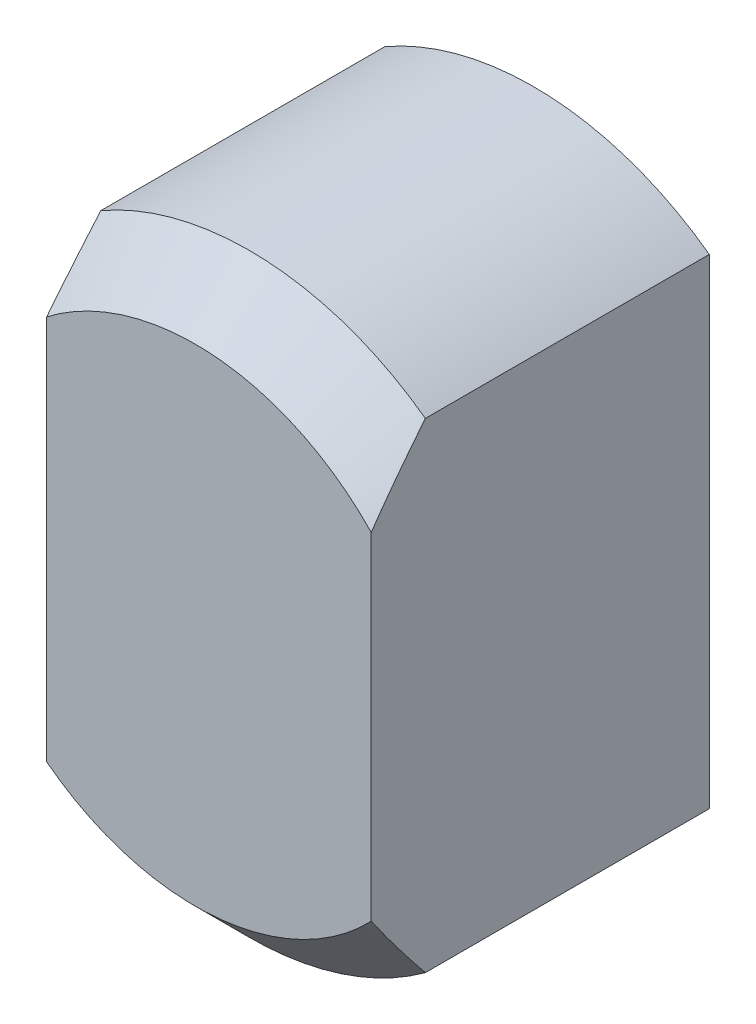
ISO-10303-21;
HEADER;
FILE_DESCRIPTION(('STEP AP214'),'2;1');
FILE_NAME('part.step','',(''),(''),'','','');
FILE_SCHEMA(('AUTOMOTIVE_DESIGN { 1 0 10303 214 1 1 1 1 }'));
ENDSEC;
DATA;
#1=APPLICATION_CONTEXT('core data for automotive mechanical design processes');
#2=APPLICATION_PROTOCOL_DEFINITION('international standard','automotive_design',2000,#1);
#3=PRODUCT_CONTEXT('',#1,'mechanical');
#4=PRODUCT('Part','Part','',(#3));
#5=PRODUCT_RELATED_PRODUCT_CATEGORY('part','',(#4));
#6=PRODUCT_DEFINITION_FORMATION('','',#4);
#7=PRODUCT_DEFINITION_CONTEXT('part definition',#1,'design');
#8=PRODUCT_DEFINITION('design','',#6,#7);
#9=PRODUCT_DEFINITION_SHAPE('','',#8);
#10=(LENGTH_UNIT() NAMED_UNIT(*) SI_UNIT(.MILLI.,.METRE.));
#11=(NAMED_UNIT(*) PLANE_ANGLE_UNIT() SI_UNIT($,.RADIAN.));
#12=(NAMED_UNIT(*) SI_UNIT($,.STERADIAN.) SOLID_ANGLE_UNIT());
#13=UNCERTAINTY_MEASURE_WITH_UNIT(LENGTH_MEASURE(1.E-05),#10,'distance_accuracy_value','');
#14=(GEOMETRIC_REPRESENTATION_CONTEXT(3) GLOBAL_UNCERTAINTY_ASSIGNED_CONTEXT((#13)) GLOBAL_UNIT_ASSIGNED_CONTEXT((#10,
#11,#12)) REPRESENTATION_CONTEXT('',''));
#15=CARTESIAN_POINT('',(0.,0.,0.));
#16=DIRECTION('',(0.,0.,1.));
#17=DIRECTION('',(1.,0.,0.));
#18=AXIS2_PLACEMENT_3D('',#15,#16,#17);
#19=CARTESIAN_POINT('',(0.,0.,158.75));
#20=DIRECTION('',(0.,0.,-1.));
#21=DIRECTION('',(-1.,0.,0.));
#22=AXIS2_PLACEMENT_3D('',#19,#20,#21);
#23=CYLINDRICAL_SURFACE('',#22,139.7);
#24=DIRECTION('',(0.,0.,-1.));
#25=VECTOR('',#24,1.);
#26=CARTESIAN_POINT('',(82.55,-112.701319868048,158.75));
#27=LINE('',#26,#25);
#28=CARTESIAN_POINT('',(82.55,-112.701319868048,133.35));
#29=VERTEX_POINT('',#28);
#30=CARTESIAN_POINT('',(82.55,-112.701319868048,0.));
#31=VERTEX_POINT('',#30);
#32=EDGE_CURVE('E86',#29,#31,#27,.T.);
#33=ORIENTED_EDGE('',*,*,#32,.F.);
#34=CARTESIAN_POINT('',(0.,0.,133.35));
#35=DIRECTION('',(0.,0.,-1.));
#36=DIRECTION('',(-1.,0.,0.));
#37=AXIS2_PLACEMENT_3D('',#34,#35,#36);
#38=CIRCLE('',#37,139.7);
#39=CARTESIAN_POINT('',(-69.85,-120.983748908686,133.35));
#40=VERTEX_POINT('',#39);
#41=EDGE_CURVE('E57',#29,#40,#38,.T.);
#42=ORIENTED_EDGE('',*,*,#41,.T.);
#43=DIRECTION('',(0.,0.,-1.));
#44=VECTOR('',#43,1.);
#45=CARTESIAN_POINT('',(-69.85,-120.983748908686,158.75));
#46=LINE('',#45,#44);
#47=CARTESIAN_POINT('',(-69.85,-120.983748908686,0.));
#48=VERTEX_POINT('',#47);
#49=EDGE_CURVE('E106',#40,#48,#46,.T.);
#50=ORIENTED_EDGE('',*,*,#49,.T.);
#51=CARTESIAN_POINT('',(0.,0.,0.));
#52=DIRECTION('',(0.,0.,1.));
#53=DIRECTION('',(-1.,0.,0.));
#54=AXIS2_PLACEMENT_3D('',#51,#52,#53);
#55=CIRCLE('',#54,139.7);
#56=EDGE_CURVE('E102',#48,#31,#55,.T.);
#57=ORIENTED_EDGE('',*,*,#56,.T.);
#58=EDGE_LOOP('',(#33,#42,#50,#57));
#59=FACE_BOUND('',#58,.T.);
#60=ADVANCED_FACE('F33',(#59),#23,.T.);
#61=CARTESIAN_POINT('',(82.55,-112.701319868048,158.75));
#62=DIRECTION('',(-1.,0.,0.));
#63=DIRECTION('',(0.,0.,1.));
#64=AXIS2_PLACEMENT_3D('',#61,#62,#63);
#65=PLANE('',#64);
#66=DIRECTION('',(0.,1.,0.));
#67=VECTOR('',#66,1.);
#68=CARTESIAN_POINT('',(82.55,-112.701319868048,158.75));
#69=LINE('',#68,#67);
#70=CARTESIAN_POINT('',(82.55,-79.0568624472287,158.75));
#71=VERTEX_POINT('',#70);
#72=CARTESIAN_POINT('',(82.55,79.0568624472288,158.75));
#73=VERTEX_POINT('',#72);
#74=EDGE_CURVE('E116',#71,#73,#69,.T.);
#75=ORIENTED_EDGE('',*,*,#74,.F.);
#76=CARTESIAN_POINT('',(82.55,-79.0568624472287,158.75));
#77=CARTESIAN_POINT('',(82.55,-80.502125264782,157.75030576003));
#78=CARTESIAN_POINT('',(82.55,-81.9407325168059,156.741040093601));
#79=CARTESIAN_POINT('',(82.55,-84.8056291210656,154.705259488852));
#80=CARTESIAN_POINT('',(82.55,-86.2319188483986,153.67874507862));
#81=CARTESIAN_POINT('',(82.55,-89.0727979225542,151.610636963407));
#82=CARTESIAN_POINT('',(82.55,-90.4873909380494,150.569048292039));
#83=CARTESIAN_POINT('',(82.55,-93.3062755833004,148.472007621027));
#84=CARTESIAN_POINT('',(82.55,-94.7105671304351,147.416555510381));
#85=CARTESIAN_POINT('',(82.55,-97.509527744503,145.293281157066));
#86=CARTESIAN_POINT('',(82.55,-98.904197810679,144.225460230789));
#87=CARTESIAN_POINT('',(82.55,-101.684821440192,142.078533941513));
#88=CARTESIAN_POINT('',(82.55,-103.070775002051,140.9994285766));
#89=CARTESIAN_POINT('',(82.55,-105.835115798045,138.83063092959));
#90=CARTESIAN_POINT('',(82.55,-107.213500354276,137.740935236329));
#91=CARTESIAN_POINT('',(82.55,-109.962831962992,135.552229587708));
#92=CARTESIAN_POINT('',(82.55,-111.333779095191,134.453219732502));
#93=CARTESIAN_POINT('',(82.55,-112.701319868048,133.35));
#94=B_SPLINE_CURVE_WITH_KNOTS('',3,(#76,#77,#78,#79,#80,#81,#82,#83,#84,#85,#86,#87,#88,#89,#90,
#91,#92,#93),.UNSPECIFIED.,.F.,.F.,(4,2,2,2,2,2,2,2,4),(0.,5.27187913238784,10.5435971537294,
15.8135936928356,21.0836324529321,26.3531153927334,31.6225992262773,36.8938406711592,
42.1650255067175),.UNSPECIFIED.);
#95=EDGE_CURVE('E93',#71,#29,#94,.T.);
#96=ORIENTED_EDGE('',*,*,#95,.T.);
#97=ORIENTED_EDGE('',*,*,#32,.T.);
#98=DIRECTION('',(0.,1.,0.));
#99=VECTOR('',#98,1.);
#100=CARTESIAN_POINT('',(82.55,-112.701319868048,0.));
#101=LINE('',#100,#99);
#102=CARTESIAN_POINT('',(82.55,112.701319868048,0.));
#103=VERTEX_POINT('',#102);
#104=EDGE_CURVE('E91',#31,#103,#101,.T.);
#105=ORIENTED_EDGE('',*,*,#104,.T.);
#106=DIRECTION('',(0.,0.,-1.));
#107=VECTOR('',#106,1.);
#108=CARTESIAN_POINT('',(82.55,112.701319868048,158.75));
#109=LINE('',#108,#107);
#110=CARTESIAN_POINT('',(82.55,112.701319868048,133.35));
#111=VERTEX_POINT('',#110);
#112=EDGE_CURVE('E96',#111,#103,#109,.T.);
#113=ORIENTED_EDGE('',*,*,#112,.F.);
#114=CARTESIAN_POINT('',(82.55,112.701319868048,133.35));
#115=CARTESIAN_POINT('',(82.55,111.333779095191,134.453219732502));
#116=CARTESIAN_POINT('',(82.55,109.962831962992,135.552229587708));
#117=CARTESIAN_POINT('',(82.55,107.213500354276,137.740935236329));
#118=CARTESIAN_POINT('',(82.55,105.835115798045,138.83063092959));
#119=CARTESIAN_POINT('',(82.55,103.070775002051,140.9994285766));
#120=CARTESIAN_POINT('',(82.55,101.684821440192,142.078533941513));
#121=CARTESIAN_POINT('',(82.55,98.904197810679,144.225460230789));
#122=CARTESIAN_POINT('',(82.55,97.509527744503,145.293281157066));
#123=CARTESIAN_POINT('',(82.55,94.7105671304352,147.416555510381));
#124=CARTESIAN_POINT('',(82.55,93.3062755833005,148.472007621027));
#125=CARTESIAN_POINT('',(82.55,90.4873909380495,150.569048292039));
#126=CARTESIAN_POINT('',(82.55,89.0727979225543,151.610636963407));
#127=CARTESIAN_POINT('',(82.55,86.2319188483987,153.67874507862));
#128=CARTESIAN_POINT('',(82.55,84.8056291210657,154.705259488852));
#129=CARTESIAN_POINT('',(82.55,81.940732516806,156.741040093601));
#130=CARTESIAN_POINT('',(82.55,80.5021252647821,157.75030576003));
#131=CARTESIAN_POINT('',(82.55,79.0568624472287,158.75));
#132=B_SPLINE_CURVE_WITH_KNOTS('',3,(#114,#115,#116,#117,#118,#119,#120,#121,#122,#123,#124,
#125,#126,#127,#128,#129,#130,#131),.UNSPECIFIED.,.F.,.F.,(4,2,2,2,2,2,2,2,4),(0.,
5.27118483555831,10.5424262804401,15.811910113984,21.0813930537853,26.3514318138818,
31.6214283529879,36.8931463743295,42.1650255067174),.UNSPECIFIED.);
#133=EDGE_CURVE('E126',#111,#73,#132,.T.);
#134=ORIENTED_EDGE('',*,*,#133,.T.);
#135=EDGE_LOOP('',(#75,#96,#97,#105,#113,#134));
#136=FACE_BOUND('',#135,.T.);
#137=ADVANCED_FACE('F89',(#136),#65,.F.);
#138=CARTESIAN_POINT('',(0.,0.,158.75));
#139=DIRECTION('',(0.,0.,-1.));
#140=DIRECTION('',(-1.,0.,0.));
#141=AXIS2_PLACEMENT_3D('',#138,#139,#140);
#142=CYLINDRICAL_SURFACE('',#141,139.7);
#143=DIRECTION('',(0.,0.,-1.));
#144=VECTOR('',#143,1.);
#145=CARTESIAN_POINT('',(-69.85,120.983748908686,158.75));
#146=LINE('',#145,#144);
#147=CARTESIAN_POINT('',(-69.85,120.983748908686,133.35));
#148=VERTEX_POINT('',#147);
#149=CARTESIAN_POINT('',(-69.85,120.983748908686,0.));
#150=VERTEX_POINT('',#149);
#151=EDGE_CURVE('E118',#148,#150,#146,.T.);
#152=ORIENTED_EDGE('',*,*,#151,.F.);
#153=CARTESIAN_POINT('',(0.,0.,133.35));
#154=DIRECTION('',(0.,0.,-1.));
#155=DIRECTION('',(-1.,0.,0.));
#156=AXIS2_PLACEMENT_3D('',#153,#154,#155);
#157=CIRCLE('',#156,139.7);
#158=EDGE_CURVE('E11',#148,#111,#157,.T.);
#159=ORIENTED_EDGE('',*,*,#158,.T.);
#160=ORIENTED_EDGE('',*,*,#112,.T.);
#161=CARTESIAN_POINT('',(0.,0.,0.));
#162=DIRECTION('',(0.,0.,1.));
#163=DIRECTION('',(1.,0.,0.));
#164=AXIS2_PLACEMENT_3D('',#161,#162,#163);
#165=CIRCLE('',#164,139.7);
#166=EDGE_CURVE('E104',#103,#150,#165,.T.);
#167=ORIENTED_EDGE('',*,*,#166,.T.);
#168=EDGE_LOOP('',(#152,#159,#160,#167));
#169=FACE_BOUND('',#168,.T.);
#170=ADVANCED_FACE('F140',(#169),#142,.T.);
#171=CARTESIAN_POINT('',(-69.85,120.983748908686,158.75));
#172=DIRECTION('',(1.,0.,0.));
#173=DIRECTION('',(0.,0.,-1.));
#174=AXIS2_PLACEMENT_3D('',#171,#172,#173);
#175=PLANE('',#174);
#176=ORIENTED_EDGE('',*,*,#49,.F.);
#177=CARTESIAN_POINT('',(-69.85,-120.983748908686,133.35));
#178=CARTESIAN_POINT('',(-69.85,-119.733186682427,134.433010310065));
#179=CARTESIAN_POINT('',(-69.85,-118.480558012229,135.513631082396));
#180=CARTESIAN_POINT('',(-69.85,-115.97080932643,137.669653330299));
#181=CARTESIAN_POINT('',(-69.85,-114.713689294,138.745054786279));
#182=CARTESIAN_POINT('',(-69.85,-110.935378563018,141.962493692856));
#183=CARTESIAN_POINT('',(-69.85,-108.406929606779,144.096032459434));
#184=CARTESIAN_POINT('',(-69.85,-104.59718655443,147.275971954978));
#185=CARTESIAN_POINT('',(-69.85,-103.324401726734,148.33257786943));
#186=CARTESIAN_POINT('',(-69.85,-100.772650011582,150.438296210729));
#187=CARTESIAN_POINT('',(-69.85,-99.4936831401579,151.487408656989));
#188=CARTESIAN_POINT('',(-69.85,-96.9288738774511,153.577509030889));
#189=CARTESIAN_POINT('',(-69.85,-95.6430306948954,154.618495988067));
#190=CARTESIAN_POINT('',(-69.85,-93.0639792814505,156.69133042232));
#191=CARTESIAN_POINT('',(-69.85,-91.7707709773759,157.723177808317));
#192=CARTESIAN_POINT('',(-69.85,-90.4735734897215,158.75));
#193=B_SPLINE_CURVE_WITH_KNOTS('',3,(#177,#178,#179,#180,#181,#182,#183,#184,#185,#186,#187,
#188,#189,#190,#191,#192),.UNSPECIFIED.,.F.,.F.,(4,2,2,2,2,2,2,4),(0.,4.96298979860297,
9.92599821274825,19.8507935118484,24.8133890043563,29.7759716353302,34.7391381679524,
39.7023541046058),.UNSPECIFIED.);
#194=CARTESIAN_POINT('',(-69.85,-90.4735734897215,158.75));
#195=VERTEX_POINT('',#194);
#196=EDGE_CURVE('E42',#40,#195,#193,.T.);
#197=ORIENTED_EDGE('',*,*,#196,.T.);
#198=DIRECTION('',(0.,-1.,0.));
#199=VECTOR('',#198,1.);
#200=CARTESIAN_POINT('',(-69.85,120.983748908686,158.75));
#201=LINE('',#200,#199);
#202=CARTESIAN_POINT('',(-69.85,90.4735734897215,158.75));
#203=VERTEX_POINT('',#202);
#204=EDGE_CURVE('E110',#203,#195,#201,.T.);
#205=ORIENTED_EDGE('',*,*,#204,.F.);
#206=CARTESIAN_POINT('',(-69.85,90.4735734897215,158.75));
#207=CARTESIAN_POINT('',(-69.85,91.770770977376,157.723177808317));
#208=CARTESIAN_POINT('',(-69.85,93.0639792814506,156.69133042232));
#209=CARTESIAN_POINT('',(-69.85,95.6430306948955,154.618495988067));
#210=CARTESIAN_POINT('',(-69.85,96.9288738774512,153.577509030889));
#211=CARTESIAN_POINT('',(-69.85,99.493683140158,151.487408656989));
#212=CARTESIAN_POINT('',(-69.85,100.772650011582,150.438296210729));
#213=CARTESIAN_POINT('',(-69.85,103.324401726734,148.33257786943));
#214=CARTESIAN_POINT('',(-69.85,104.59718655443,147.275971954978));
#215=CARTESIAN_POINT('',(-69.85,108.406929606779,144.096032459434));
#216=CARTESIAN_POINT('',(-69.85,110.935378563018,141.962493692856));
#217=CARTESIAN_POINT('',(-69.85,114.713689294,138.745054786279));
#218=CARTESIAN_POINT('',(-69.85,115.97080932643,137.669653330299));
#219=CARTESIAN_POINT('',(-69.85,118.480558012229,135.513631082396));
#220=CARTESIAN_POINT('',(-69.85,119.733186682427,134.433010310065));
#221=CARTESIAN_POINT('',(-69.85,120.983748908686,133.35));
#222=B_SPLINE_CURVE_WITH_KNOTS('',3,(#206,#207,#208,#209,#210,#211,#212,#213,#214,#215,#216,
#217,#218,#219,#220,#221),.UNSPECIFIED.,.F.,.F.,(4,2,2,2,2,2,2,4),(0.,4.96321593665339,
9.92638246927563,14.8889651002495,19.8515605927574,29.7763558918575,34.7393643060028,
39.7023541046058),.UNSPECIFIED.);
#223=EDGE_CURVE('E49',#203,#148,#222,.T.);
#224=ORIENTED_EDGE('',*,*,#223,.T.);
#225=ORIENTED_EDGE('',*,*,#151,.T.);
#226=DIRECTION('',(0.,-1.,0.));
#227=VECTOR('',#226,1.);
#228=CARTESIAN_POINT('',(-69.85,120.983748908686,0.));
#229=LINE('',#228,#227);
#230=EDGE_CURVE('E114',#150,#48,#229,.T.);
#231=ORIENTED_EDGE('',*,*,#230,.T.);
#232=EDGE_LOOP('',(#176,#197,#205,#224,#225,#231));
#233=FACE_BOUND('',#232,.T.);
#234=ADVANCED_FACE('F156',(#233),#175,.F.);
#235=CARTESIAN_POINT('',(0.,0.,158.75));
#236=DIRECTION('',(0.,0.,-1.));
#237=DIRECTION('',(-1.,0.,0.));
#238=AXIS2_PLACEMENT_3D('',#235,#236,#237);
#239=PLANE('',#238);
#240=ORIENTED_EDGE('',*,*,#204,.T.);
#241=CARTESIAN_POINT('',(0.,0.,158.75));
#242=DIRECTION('',(0.,0.,-1.));
#243=DIRECTION('',(-1.,0.,0.));
#244=AXIS2_PLACEMENT_3D('',#241,#242,#243);
#245=CIRCLE('',#244,114.3);
#246=EDGE_CURVE('E123',#195,#71,#245,.F.);
#247=ORIENTED_EDGE('',*,*,#246,.T.);
#248=ORIENTED_EDGE('',*,*,#74,.T.);
#249=CARTESIAN_POINT('',(0.,0.,158.75));
#250=DIRECTION('',(0.,0.,-1.));
#251=DIRECTION('',(-1.,0.,0.));
#252=AXIS2_PLACEMENT_3D('',#249,#250,#251);
#253=CIRCLE('',#252,114.3);
#254=EDGE_CURVE('E95',#73,#203,#253,.F.);
#255=ORIENTED_EDGE('',*,*,#254,.T.);
#256=EDGE_LOOP('',(#240,#247,#248,#255));
#257=FACE_BOUND('',#256,.T.);
#258=ADVANCED_FACE('F160',(#257),#239,.F.);
#259=CARTESIAN_POINT('',(0.,0.,0.));
#260=DIRECTION('',(0.,0.,-1.));
#261=DIRECTION('',(-1.,0.,0.));
#262=AXIS2_PLACEMENT_3D('',#259,#260,#261);
#263=PLANE('',#262);
#264=ORIENTED_EDGE('',*,*,#56,.F.);
#265=ORIENTED_EDGE('',*,*,#230,.F.);
#266=ORIENTED_EDGE('',*,*,#166,.F.);
#267=ORIENTED_EDGE('',*,*,#104,.F.);
#268=EDGE_LOOP('',(#264,#265,#266,#267));
#269=FACE_BOUND('',#268,.T.);
#270=ADVANCED_FACE('F100',(#269),#263,.T.);
#271=CARTESIAN_POINT('',(0.,0.,158.75));
#272=DIRECTION('',(0.,0.,-1.));
#273=DIRECTION('',(-1.,0.,0.));
#274=AXIS2_PLACEMENT_3D('',#271,#272,#273);
#275=CONICAL_SURFACE('',#274,114.3,0.785398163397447);
#276=ORIENTED_EDGE('',*,*,#196,.F.);
#277=ORIENTED_EDGE('',*,*,#41,.F.);
#278=ORIENTED_EDGE('',*,*,#95,.F.);
#279=ORIENTED_EDGE('',*,*,#246,.F.);
#280=EDGE_LOOP('',(#276,#277,#278,#279));
#281=FACE_BOUND('',#280,.T.);
#282=ADVANCED_FACE('F144',(#281),#275,.T.);
#283=CARTESIAN_POINT('',(0.,0.,158.75));
#284=DIRECTION('',(0.,0.,-1.));
#285=DIRECTION('',(-1.,0.,0.));
#286=AXIS2_PLACEMENT_3D('',#283,#284,#285);
#287=CONICAL_SURFACE('',#286,114.3,0.785398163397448);
#288=ORIENTED_EDGE('',*,*,#133,.F.);
#289=ORIENTED_EDGE('',*,*,#158,.F.);
#290=ORIENTED_EDGE('',*,*,#223,.F.);
#291=ORIENTED_EDGE('',*,*,#254,.F.);
#292=EDGE_LOOP('',(#288,#289,#290,#291));
#293=FACE_BOUND('',#292,.T.);
#294=ADVANCED_FACE('F35',(#293),#287,.T.);
#295=CLOSED_SHELL('',(#60,#137,#170,#234,#258,#270,#282,#294));
#296=MANIFOLD_SOLID_BREP('B2',#295);
#297=ADVANCED_BREP_SHAPE_REPRESENTATION('',(#18,#296),#14);
#298=SHAPE_DEFINITION_REPRESENTATION(#9,#297);
ENDSEC;
END-ISO-10303-21;
